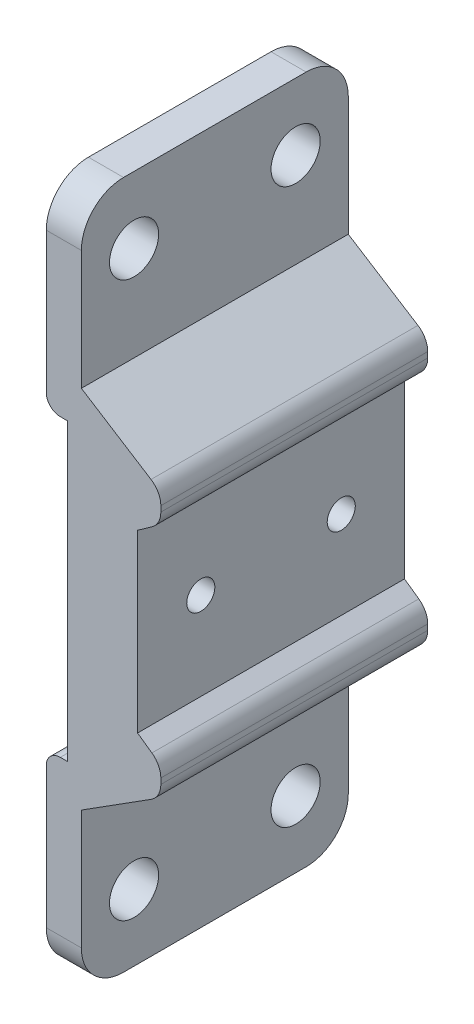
from build123d import *

# Parameters (mm, degrees)
BASE_EXTRUSION_DEPTH    = 19
ENL_V_MAT_EXTRU_1_DEPTH = 16
CONG_1_R                = 2
ESQUISSE3_R             = 2
ESQUISSE3_R_2           = 3.5
ENL_V_MAT_EXTRU_2_DEPTH = 62
CONG_2_R                = 6


with BuildPart() as part:
    # Esquisse1 → Base-Extrusion (new, symmetric)
    with BuildSketch(Plane.XY):
        with BuildLine():
            Line((0, 49), (5, 49))
            Line((5, 49), (5, 26))
            Line((5, 26), (14.916897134, 19.719298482))
            ThreePointArc((14.916897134, 19.719298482), (15.939997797, 18.631307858), (16.311740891, 17.184841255))
            Line((16.311740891, 17.184841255), (16.311740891, 16.391056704))
            ThreePointArc((16.311740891, 16.391056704), (15.975148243, 15.010382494), (15.040900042, 13.939524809))
            Line((15.040900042, 13.939524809), (13, 12.5))
            Line((13, 12.5), (13, -12.5))
            Line((13, -12.5), (15.040900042, -13.939524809))
            ThreePointArc((15.040900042, -13.939524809), (15.975148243, -15.010382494), (16.311740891, -16.391056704))
            Line((16.311740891, -16.391056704), (16.311740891, -17.184841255))
            ThreePointArc((16.311740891, -17.184841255), (15.939997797, -18.631307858), (14.916897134, -19.719298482))
            Line((14.916897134, -19.719298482), (5, -26))
            Line((5, -26), (5, -49))
            Line((5, -49), (0, -49))
            Line((0, -49), (0, -21))
            Line((0, -21), (3, -21))
            Line((3, -21), (3, 21))
            Line((3, 21), (0, 21))
            Line((0, 21), (0, 49))
        make_face()
    extrude(amount=BASE_EXTRUSION_DEPTH, both=True)

    # Esquisse2 → Enl_v. mat.-Extru.1 (cut, symmetric)
    with BuildSketch(Plane.XY):
        Polygon((3, 21), (-3.159169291, 16.354511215), (-3.159169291, -16.354511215), (3, -21), (7.914046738, -17.644167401), (7.914046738, 17.644167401), align=None)
    extrude(amount=ENL_V_MAT_EXTRU_1_DEPTH, both=True, mode=Mode.SUBTRACT)

    # Cong_1
    cong_1_edges = [part.edges().sort_by_distance(p)[0] for p in [
        (0, 21, 0),
        (0, -21, 0),
    ]]
    fillet(cong_1_edges, radius=CONG_1_R)

    # Esquisse3 → Enl_v. mat.-Extru.2 (cut)
    with BuildSketch(Plane.ZY):
        with Locations(Location((10, 0, 0), (0, 0, 180))):
            Circle(ESQUISSE3_R)
        with Locations(Location((11.5, 39.5, 0), (0, 0, 270))):
            Circle(ESQUISSE3_R_2)
        with Locations(Location((11.5, -39.5, 0), (0, 0, 270))):
            Circle(ESQUISSE3_R_2)
        with Locations(Location((-11.5, 39.5, 0), (0, 0, 270))):
            Circle(ESQUISSE3_R_2)
        with Locations(Location((-10, 0, 0), (0, 0, 180))):
            Circle(ESQUISSE3_R)
        with Locations(Location((-11.5, -39.5, 0), (0, 0, 270))):
            Circle(ESQUISSE3_R_2)
    extrude(amount=-ENL_V_MAT_EXTRU_2_DEPTH, mode=Mode.SUBTRACT)

    # Cong_2
    cong_2_edges = [part.edges().sort_by_distance(p)[0] for p in [
        (2.5, -49, -19),
        (2.5, 49, -19),
        (2.5, 49, 19),
        (2.5, -49, 19),
    ]]
    fillet(cong_2_edges, radius=CONG_2_R)


solid = part.part
